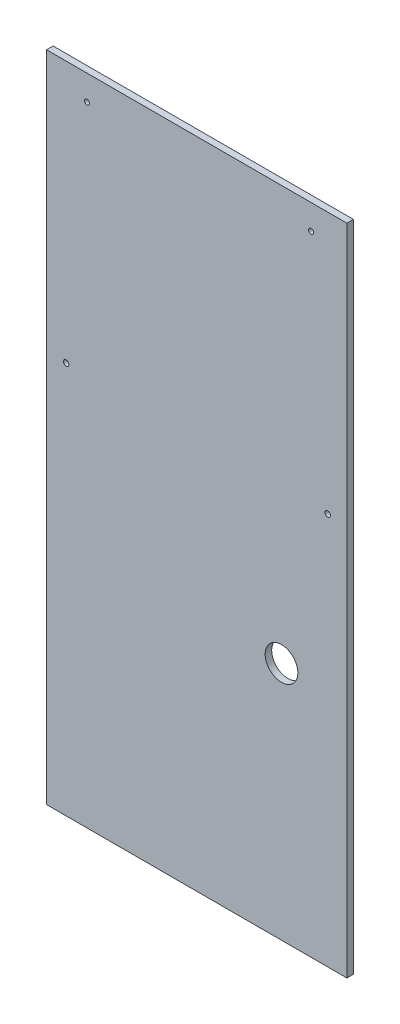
ISO-10303-21;
HEADER;
FILE_DESCRIPTION(('STEP AP214'),'2;1');
FILE_NAME('part.step','',(''),(''),'','','');
FILE_SCHEMA(('AUTOMOTIVE_DESIGN { 1 0 10303 214 1 1 1 1 }'));
ENDSEC;
DATA;
#1=APPLICATION_CONTEXT('core data for automotive mechanical design processes');
#2=APPLICATION_PROTOCOL_DEFINITION('international standard','automotive_design',2000,#1);
#3=PRODUCT_CONTEXT('',#1,'mechanical');
#4=PRODUCT('Part','Part','',(#3));
#5=PRODUCT_RELATED_PRODUCT_CATEGORY('part','',(#4));
#6=PRODUCT_DEFINITION_FORMATION('','',#4);
#7=PRODUCT_DEFINITION_CONTEXT('part definition',#1,'design');
#8=PRODUCT_DEFINITION('design','',#6,#7);
#9=PRODUCT_DEFINITION_SHAPE('','',#8);
#10=(LENGTH_UNIT() NAMED_UNIT(*) SI_UNIT(.MILLI.,.METRE.));
#11=(NAMED_UNIT(*) PLANE_ANGLE_UNIT() SI_UNIT($,.RADIAN.));
#12=(NAMED_UNIT(*) SI_UNIT($,.STERADIAN.) SOLID_ANGLE_UNIT());
#13=UNCERTAINTY_MEASURE_WITH_UNIT(LENGTH_MEASURE(1.E-05),#10,'distance_accuracy_value','');
#14=(GEOMETRIC_REPRESENTATION_CONTEXT(3) GLOBAL_UNCERTAINTY_ASSIGNED_CONTEXT((#13)) GLOBAL_UNIT_ASSIGNED_CONTEXT((#10,
#11,#12)) REPRESENTATION_CONTEXT('',''));
#15=CARTESIAN_POINT('',(0.,0.,0.));
#16=DIRECTION('',(0.,0.,1.));
#17=DIRECTION('',(1.,0.,0.));
#18=AXIS2_PLACEMENT_3D('',#15,#16,#17);
#19=CARTESIAN_POINT('',(175.006,-381.,7.62));
#20=DIRECTION('',(-1.,0.,0.));
#21=DIRECTION('',(0.,0.,1.));
#22=AXIS2_PLACEMENT_3D('',#19,#20,#21);
#23=PLANE('',#22);
#24=DIRECTION('',(0.,1.,0.));
#25=VECTOR('',#24,1.);
#26=CARTESIAN_POINT('',(175.006,-381.,0.));
#27=LINE('',#26,#25);
#28=CARTESIAN_POINT('',(175.006,-381.,0.));
#29=VERTEX_POINT('',#28);
#30=CARTESIAN_POINT('',(175.006,381.,0.));
#31=VERTEX_POINT('',#30);
#32=EDGE_CURVE('E102',#29,#31,#27,.T.);
#33=ORIENTED_EDGE('',*,*,#32,.T.);
#34=DIRECTION('',(0.,0.,-1.));
#35=VECTOR('',#34,1.);
#36=CARTESIAN_POINT('',(175.006,381.,7.62));
#37=LINE('',#36,#35);
#38=CARTESIAN_POINT('',(175.006,381.,7.62));
#39=VERTEX_POINT('',#38);
#40=EDGE_CURVE('E11',#39,#31,#37,.T.);
#41=ORIENTED_EDGE('',*,*,#40,.F.);
#42=DIRECTION('',(0.,1.,0.));
#43=VECTOR('',#42,1.);
#44=CARTESIAN_POINT('',(175.006,-381.,7.62));
#45=LINE('',#44,#43);
#46=CARTESIAN_POINT('',(175.006,-381.,7.62));
#47=VERTEX_POINT('',#46);
#48=EDGE_CURVE('E90',#47,#39,#45,.T.);
#49=ORIENTED_EDGE('',*,*,#48,.F.);
#50=DIRECTION('',(0.,0.,-1.));
#51=VECTOR('',#50,1.);
#52=CARTESIAN_POINT('',(175.006,-381.,7.62));
#53=LINE('',#52,#51);
#54=EDGE_CURVE('E98',#47,#29,#53,.T.);
#55=ORIENTED_EDGE('',*,*,#54,.T.);
#56=EDGE_LOOP('',(#33,#41,#49,#55));
#57=FACE_BOUND('',#56,.T.);
#58=ADVANCED_FACE('F39',(#57),#23,.F.);
#59=CARTESIAN_POINT('',(-175.006,381.,7.62));
#60=DIRECTION('',(0.,-1.,0.));
#61=DIRECTION('',(0.,0.,-1.));
#62=AXIS2_PLACEMENT_3D('',#59,#60,#61);
#63=PLANE('',#62);
#64=DIRECTION('',(-1.,0.,0.));
#65=VECTOR('',#64,1.);
#66=CARTESIAN_POINT('',(-175.006,381.,0.));
#67=LINE('',#66,#65);
#68=CARTESIAN_POINT('',(-175.006,381.,0.));
#69=VERTEX_POINT('',#68);
#70=EDGE_CURVE('E94',#31,#69,#67,.T.);
#71=ORIENTED_EDGE('',*,*,#70,.T.);
#72=DIRECTION('',(0.,0.,-1.));
#73=VECTOR('',#72,1.);
#74=CARTESIAN_POINT('',(-175.006,381.,7.62));
#75=LINE('',#74,#73);
#76=CARTESIAN_POINT('',(-175.006,381.,7.62));
#77=VERTEX_POINT('',#76);
#78=EDGE_CURVE('E47',#77,#69,#75,.T.);
#79=ORIENTED_EDGE('',*,*,#78,.F.);
#80=DIRECTION('',(-1.,0.,0.));
#81=VECTOR('',#80,1.);
#82=CARTESIAN_POINT('',(-175.006,381.,7.62));
#83=LINE('',#82,#81);
#84=EDGE_CURVE('E85',#39,#77,#83,.T.);
#85=ORIENTED_EDGE('',*,*,#84,.F.);
#86=ORIENTED_EDGE('',*,*,#40,.T.);
#87=EDGE_LOOP('',(#71,#79,#85,#86));
#88=FACE_BOUND('',#87,.T.);
#89=ADVANCED_FACE('F93',(#88),#63,.F.);
#90=CARTESIAN_POINT('',(-175.006,-381.,7.62));
#91=DIRECTION('',(1.,0.,0.));
#92=DIRECTION('',(0.,0.,-1.));
#93=AXIS2_PLACEMENT_3D('',#90,#91,#92);
#94=PLANE('',#93);
#95=DIRECTION('',(0.,-1.,0.));
#96=VECTOR('',#95,1.);
#97=CARTESIAN_POINT('',(-175.006,-381.,0.));
#98=LINE('',#97,#96);
#99=CARTESIAN_POINT('',(-175.006,-381.,0.));
#100=VERTEX_POINT('',#99);
#101=EDGE_CURVE('E72',#69,#100,#98,.T.);
#102=ORIENTED_EDGE('',*,*,#101,.T.);
#103=DIRECTION('',(0.,0.,-1.));
#104=VECTOR('',#103,1.);
#105=CARTESIAN_POINT('',(-175.006,-381.,7.62));
#106=LINE('',#105,#104);
#107=CARTESIAN_POINT('',(-175.006,-381.,7.62));
#108=VERTEX_POINT('',#107);
#109=EDGE_CURVE('E95',#108,#100,#106,.T.);
#110=ORIENTED_EDGE('',*,*,#109,.F.);
#111=DIRECTION('',(0.,-1.,0.));
#112=VECTOR('',#111,1.);
#113=CARTESIAN_POINT('',(-175.006,-381.,7.62));
#114=LINE('',#113,#112);
#115=EDGE_CURVE('E88',#77,#108,#114,.T.);
#116=ORIENTED_EDGE('',*,*,#115,.F.);
#117=ORIENTED_EDGE('',*,*,#78,.T.);
#118=EDGE_LOOP('',(#102,#110,#116,#117));
#119=FACE_BOUND('',#118,.T.);
#120=ADVANCED_FACE('F96',(#119),#94,.F.);
#121=CARTESIAN_POINT('',(-175.006,-381.,7.62));
#122=DIRECTION('',(0.,1.,0.));
#123=DIRECTION('',(0.,0.,1.));
#124=AXIS2_PLACEMENT_3D('',#121,#122,#123);
#125=PLANE('',#124);
#126=DIRECTION('',(1.,0.,0.));
#127=VECTOR('',#126,1.);
#128=CARTESIAN_POINT('',(-175.006,-381.,0.));
#129=LINE('',#128,#127);
#130=EDGE_CURVE('E78',#100,#29,#129,.T.);
#131=ORIENTED_EDGE('',*,*,#130,.T.);
#132=ORIENTED_EDGE('',*,*,#54,.F.);
#133=DIRECTION('',(1.,0.,0.));
#134=VECTOR('',#133,1.);
#135=CARTESIAN_POINT('',(-175.006,-381.,7.62));
#136=LINE('',#135,#134);
#137=EDGE_CURVE('E55',#108,#47,#136,.T.);
#138=ORIENTED_EDGE('',*,*,#137,.F.);
#139=ORIENTED_EDGE('',*,*,#109,.T.);
#140=EDGE_LOOP('',(#131,#132,#138,#139));
#141=FACE_BOUND('',#140,.T.);
#142=ADVANCED_FACE('F110',(#141),#125,.F.);
#143=CARTESIAN_POINT('',(0.,0.,7.62));
#144=DIRECTION('',(0.,0.,-1.));
#145=DIRECTION('',(-1.,0.,0.));
#146=AXIS2_PLACEMENT_3D('',#143,#144,#145);
#147=PLANE('',#146);
#148=CARTESIAN_POINT('',(152.60870096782,76.2,7.62));
#149=DIRECTION('',(0.,0.,1.));
#150=DIRECTION('',(1.,0.,0.));
#151=AXIS2_PLACEMENT_3D('',#148,#149,#150);
#152=CIRCLE('',#151,3.17499999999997);
#153=CARTESIAN_POINT('',(155.78370096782,76.2,7.62));
#154=VERTEX_POINT('',#153);
#155=EDGE_CURVE('E140',#154,#154,#152,.T.);
#156=ORIENTED_EDGE('',*,*,#155,.F.);
#157=EDGE_LOOP('',(#156));
#158=FACE_BOUND('',#157,.T.);
#159=CARTESIAN_POINT('',(-152.146,76.2,7.62));
#160=DIRECTION('',(0.,0.,1.));
#161=DIRECTION('',(1.,0.,0.));
#162=AXIS2_PLACEMENT_3D('',#159,#160,#161);
#163=CIRCLE('',#162,3.17499999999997);
#164=CARTESIAN_POINT('',(-148.971,76.2,7.62));
#165=VERTEX_POINT('',#164);
#166=EDGE_CURVE('E134',#165,#165,#163,.T.);
#167=ORIENTED_EDGE('',*,*,#166,.F.);
#168=EDGE_LOOP('',(#167));
#169=FACE_BOUND('',#168,.T.);
#170=CARTESIAN_POINT('',(98.806,-101.6,7.62));
#171=DIRECTION('',(0.,0.,1.));
#172=DIRECTION('',(1.,0.,0.));
#173=AXIS2_PLACEMENT_3D('',#170,#171,#172);
#174=CIRCLE('',#173,19.05);
#175=CARTESIAN_POINT('',(117.856,-101.6,7.62));
#176=VERTEX_POINT('',#175);
#177=EDGE_CURVE('E128',#176,#176,#174,.T.);
#178=ORIENTED_EDGE('',*,*,#177,.F.);
#179=EDGE_LOOP('',(#178));
#180=FACE_BOUND('',#179,.T.);
#181=CARTESIAN_POINT('',(-128.016,351.79,7.62));
#182=DIRECTION('',(0.,0.,1.));
#183=DIRECTION('',(1.,0.,0.));
#184=AXIS2_PLACEMENT_3D('',#181,#182,#183);
#185=CIRCLE('',#184,2.921);
#186=CARTESIAN_POINT('',(-125.095,351.79,7.62));
#187=VERTEX_POINT('',#186);
#188=EDGE_CURVE('E123',#187,#187,#185,.T.);
#189=ORIENTED_EDGE('',*,*,#188,.F.);
#190=EDGE_LOOP('',(#189));
#191=FACE_BOUND('',#190,.T.);
#192=CARTESIAN_POINT('',(133.35,351.79,7.62));
#193=DIRECTION('',(0.,0.,1.));
#194=DIRECTION('',(1.,0.,0.));
#195=AXIS2_PLACEMENT_3D('',#192,#193,#194);
#196=CIRCLE('',#195,2.921);
#197=CARTESIAN_POINT('',(136.271,351.79,7.62));
#198=VERTEX_POINT('',#197);
#199=EDGE_CURVE('E116',#198,#198,#196,.T.);
#200=ORIENTED_EDGE('',*,*,#199,.F.);
#201=EDGE_LOOP('',(#200));
#202=FACE_BOUND('',#201,.T.);
#203=ORIENTED_EDGE('',*,*,#48,.T.);
#204=ORIENTED_EDGE('',*,*,#84,.T.);
#205=ORIENTED_EDGE('',*,*,#115,.T.);
#206=ORIENTED_EDGE('',*,*,#137,.T.);
#207=EDGE_LOOP('',(#203,#204,#205,#206));
#208=FACE_BOUND('',#207,.T.);
#209=ADVANCED_FACE('F86',(#158,#169,#180,#191,#202,#208),#147,.F.);
#210=CARTESIAN_POINT('',(0.,0.,0.));
#211=DIRECTION('',(0.,0.,-1.));
#212=DIRECTION('',(-1.,0.,0.));
#213=AXIS2_PLACEMENT_3D('',#210,#211,#212);
#214=PLANE('',#213);
#215=CARTESIAN_POINT('',(152.60870096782,76.2,0.));
#216=DIRECTION('',(0.,0.,1.));
#217=DIRECTION('',(1.,0.,0.));
#218=AXIS2_PLACEMENT_3D('',#215,#216,#217);
#219=CIRCLE('',#218,3.17499999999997);
#220=CARTESIAN_POINT('',(155.78370096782,76.2,0.));
#221=VERTEX_POINT('',#220);
#222=EDGE_CURVE('E131',#221,#221,#219,.T.);
#223=ORIENTED_EDGE('',*,*,#222,.T.);
#224=EDGE_LOOP('',(#223));
#225=FACE_BOUND('',#224,.T.);
#226=CARTESIAN_POINT('',(-152.146,76.2,0.));
#227=DIRECTION('',(0.,0.,1.));
#228=DIRECTION('',(1.,0.,0.));
#229=AXIS2_PLACEMENT_3D('',#226,#227,#228);
#230=CIRCLE('',#229,3.17499999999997);
#231=CARTESIAN_POINT('',(-148.971,76.2,0.));
#232=VERTEX_POINT('',#231);
#233=EDGE_CURVE('E137',#232,#232,#230,.T.);
#234=ORIENTED_EDGE('',*,*,#233,.T.);
#235=EDGE_LOOP('',(#234));
#236=FACE_BOUND('',#235,.T.);
#237=CARTESIAN_POINT('',(98.806,-101.6,0.));
#238=DIRECTION('',(0.,0.,1.));
#239=DIRECTION('',(1.,0.,0.));
#240=AXIS2_PLACEMENT_3D('',#237,#238,#239);
#241=CIRCLE('',#240,19.05);
#242=CARTESIAN_POINT('',(117.856,-101.6,0.));
#243=VERTEX_POINT('',#242);
#244=EDGE_CURVE('E120',#243,#243,#241,.T.);
#245=ORIENTED_EDGE('',*,*,#244,.T.);
#246=EDGE_LOOP('',(#245));
#247=FACE_BOUND('',#246,.T.);
#248=CARTESIAN_POINT('',(-128.016,351.79,0.));
#249=DIRECTION('',(0.,0.,1.));
#250=DIRECTION('',(1.,0.,0.));
#251=AXIS2_PLACEMENT_3D('',#248,#249,#250);
#252=CIRCLE('',#251,2.921);
#253=CARTESIAN_POINT('',(-125.095,351.79,0.));
#254=VERTEX_POINT('',#253);
#255=EDGE_CURVE('E105',#254,#254,#252,.T.);
#256=ORIENTED_EDGE('',*,*,#255,.T.);
#257=EDGE_LOOP('',(#256));
#258=FACE_BOUND('',#257,.T.);
#259=CARTESIAN_POINT('',(133.35,351.79,0.));
#260=DIRECTION('',(0.,0.,1.));
#261=DIRECTION('',(1.,0.,0.));
#262=AXIS2_PLACEMENT_3D('',#259,#260,#261);
#263=CIRCLE('',#262,2.921);
#264=CARTESIAN_POINT('',(136.271,351.79,0.));
#265=VERTEX_POINT('',#264);
#266=EDGE_CURVE('E119',#265,#265,#263,.T.);
#267=ORIENTED_EDGE('',*,*,#266,.T.);
#268=EDGE_LOOP('',(#267));
#269=FACE_BOUND('',#268,.T.);
#270=ORIENTED_EDGE('',*,*,#32,.F.);
#271=ORIENTED_EDGE('',*,*,#130,.F.);
#272=ORIENTED_EDGE('',*,*,#101,.F.);
#273=ORIENTED_EDGE('',*,*,#70,.F.);
#274=EDGE_LOOP('',(#270,#271,#272,#273));
#275=FACE_BOUND('',#274,.T.);
#276=ADVANCED_FACE('F113',(#225,#236,#247,#258,#269,#275),#214,.T.);
#277=CARTESIAN_POINT('',(133.35,351.79,0.));
#278=DIRECTION('',(0.,0.,1.));
#279=DIRECTION('',(1.,0.,0.));
#280=AXIS2_PLACEMENT_3D('',#277,#278,#279);
#281=CYLINDRICAL_SURFACE('',#280,2.921);
#282=CARTESIAN_POINT('',(136.271,351.79,0.));
#283=CARTESIAN_POINT('',(136.271,351.79,0.0793749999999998));
#284=CARTESIAN_POINT('',(136.271,351.79,0.15875));
#285=CARTESIAN_POINT('',(136.271,351.79,0.3175));
#286=CARTESIAN_POINT('',(136.271,351.79,0.396875));
#287=CARTESIAN_POINT('',(136.271,351.79,0.555625));
#288=CARTESIAN_POINT('',(136.271,351.79,0.635));
#289=CARTESIAN_POINT('',(136.271,351.79,0.79375));
#290=CARTESIAN_POINT('',(136.271,351.79,0.873125));
#291=CARTESIAN_POINT('',(136.271,351.79,1.031875));
#292=CARTESIAN_POINT('',(136.271,351.79,1.11125));
#293=CARTESIAN_POINT('',(136.271,351.79,1.27));
#294=CARTESIAN_POINT('',(136.271,351.79,1.349375));
#295=CARTESIAN_POINT('',(136.271,351.79,1.508125));
#296=CARTESIAN_POINT('',(136.271,351.79,1.5875));
#297=CARTESIAN_POINT('',(136.271,351.79,1.74625));
#298=CARTESIAN_POINT('',(136.271,351.79,1.825625));
#299=CARTESIAN_POINT('',(136.271,351.79,1.984375));
#300=CARTESIAN_POINT('',(136.271,351.79,2.06375));
#301=CARTESIAN_POINT('',(136.271,351.79,2.2225));
#302=CARTESIAN_POINT('',(136.271,351.79,2.301875));
#303=CARTESIAN_POINT('',(136.271,351.79,2.460625));
#304=CARTESIAN_POINT('',(136.271,351.79,2.54));
#305=CARTESIAN_POINT('',(136.271,351.79,2.69875));
#306=CARTESIAN_POINT('',(136.271,351.79,2.778125));
#307=CARTESIAN_POINT('',(136.271,351.79,2.936875));
#308=CARTESIAN_POINT('',(136.271,351.79,3.01625));
#309=CARTESIAN_POINT('',(136.271,351.79,3.175));
#310=CARTESIAN_POINT('',(136.271,351.79,3.254375));
#311=CARTESIAN_POINT('',(136.271,351.79,3.413125));
#312=CARTESIAN_POINT('',(136.271,351.79,3.4925));
#313=CARTESIAN_POINT('',(136.271,351.79,3.65125));
#314=CARTESIAN_POINT('',(136.271,351.79,3.730625));
#315=CARTESIAN_POINT('',(136.271,351.79,3.889375));
#316=CARTESIAN_POINT('',(136.271,351.79,3.96875));
#317=CARTESIAN_POINT('',(136.271,351.79,4.1275));
#318=CARTESIAN_POINT('',(136.271,351.79,4.206875));
#319=CARTESIAN_POINT('',(136.271,351.79,4.365625));
#320=CARTESIAN_POINT('',(136.271,351.79,4.445));
#321=CARTESIAN_POINT('',(136.271,351.79,4.60375));
#322=CARTESIAN_POINT('',(136.271,351.79,4.683125));
#323=CARTESIAN_POINT('',(136.271,351.79,4.841875));
#324=CARTESIAN_POINT('',(136.271,351.79,4.92125));
#325=CARTESIAN_POINT('',(136.271,351.79,5.08));
#326=CARTESIAN_POINT('',(136.271,351.79,5.159375));
#327=CARTESIAN_POINT('',(136.271,351.79,5.318125));
#328=CARTESIAN_POINT('',(136.271,351.79,5.3975));
#329=CARTESIAN_POINT('',(136.271,351.79,5.55625));
#330=CARTESIAN_POINT('',(136.271,351.79,5.635625));
#331=CARTESIAN_POINT('',(136.271,351.79,5.794375));
#332=CARTESIAN_POINT('',(136.271,351.79,5.87375));
#333=CARTESIAN_POINT('',(136.271,351.79,6.0325));
#334=CARTESIAN_POINT('',(136.271,351.79,6.111875));
#335=CARTESIAN_POINT('',(136.271,351.79,6.270625));
#336=CARTESIAN_POINT('',(136.271,351.79,6.35));
#337=CARTESIAN_POINT('',(136.271,351.79,6.50875));
#338=CARTESIAN_POINT('',(136.271,351.79,6.588125));
#339=CARTESIAN_POINT('',(136.271,351.79,6.746875));
#340=CARTESIAN_POINT('',(136.271,351.79,6.82625));
#341=CARTESIAN_POINT('',(136.271,351.79,6.985));
#342=CARTESIAN_POINT('',(136.271,351.79,7.064375));
#343=CARTESIAN_POINT('',(136.271,351.79,7.223125));
#344=CARTESIAN_POINT('',(136.271,351.79,7.3025));
#345=CARTESIAN_POINT('',(136.271,351.79,7.46125));
#346=CARTESIAN_POINT('',(136.271,351.79,7.540625));
#347=CARTESIAN_POINT('',(136.271,351.79,7.62));
#348=B_SPLINE_CURVE_WITH_KNOTS('',3,(#282,#283,#284,#285,#286,#287,#288,#289,#290,#291,#292,
#293,#294,#295,#296,#297,#298,#299,#300,#301,#302,#303,#304,#305,#306,#307,#308,#309,#310,#311,
#312,#313,#314,#315,#316,#317,#318,#319,#320,#321,#322,#323,#324,#325,#326,#327,#328,#329,#330,
#331,#332,#333,#334,#335,#336,#337,#338,#339,#340,#341,#342,#343,#344,#345,#346,#347),
.UNSPECIFIED.,.F.,.F.,(4,2,2,2,2,2,2,2,2,2,2,2,2,2,2,2,2,2,2,2,2,2,2,2,2,2,2,2,2,2,2,2,4),(0.,
0.238125,0.47625,0.714375,0.9525,1.190625,1.42875,1.666875,1.905,2.143125,2.38125,2.619375,
2.8575,3.095625,3.33375,3.571875,3.81,4.048125,4.28625,4.524375,4.7625,5.000625,5.23875,
5.476875,5.715,5.953125,6.19125,6.429375,6.6675,6.905625,7.14375,7.381875,7.62),.UNSPECIFIED.);
#349=EDGE_CURVE('BSEAM166',#265,#198,#348,.T.);
#350=ORIENTED_EDGE('',*,*,#266,.F.);
#351=ORIENTED_EDGE('',*,*,#199,.T.);
#352=ORIENTED_EDGE('',*,*,#349,.T.);
#353=ORIENTED_EDGE('',*,*,#349,.F.);
#354=EDGE_LOOP('',(#350,#352,#351,#353));
#355=FACE_BOUND('',#354,.T.);
#356=ADVANCED_FACE('F166',(#355),#281,.F.);
#357=CARTESIAN_POINT('',(-128.016,351.79,0.));
#358=DIRECTION('',(0.,0.,1.));
#359=DIRECTION('',(1.,0.,0.));
#360=AXIS2_PLACEMENT_3D('',#357,#358,#359);
#361=CYLINDRICAL_SURFACE('',#360,2.921);
#362=CARTESIAN_POINT('',(-125.095,351.79,0.));
#363=CARTESIAN_POINT('',(-125.095,351.79,0.0793749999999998));
#364=CARTESIAN_POINT('',(-125.095,351.79,0.15875));
#365=CARTESIAN_POINT('',(-125.095,351.79,0.3175));
#366=CARTESIAN_POINT('',(-125.095,351.79,0.396875));
#367=CARTESIAN_POINT('',(-125.095,351.79,0.555625));
#368=CARTESIAN_POINT('',(-125.095,351.79,0.635));
#369=CARTESIAN_POINT('',(-125.095,351.79,0.79375));
#370=CARTESIAN_POINT('',(-125.095,351.79,0.873125));
#371=CARTESIAN_POINT('',(-125.095,351.79,1.031875));
#372=CARTESIAN_POINT('',(-125.095,351.79,1.11125));
#373=CARTESIAN_POINT('',(-125.095,351.79,1.27));
#374=CARTESIAN_POINT('',(-125.095,351.79,1.349375));
#375=CARTESIAN_POINT('',(-125.095,351.79,1.508125));
#376=CARTESIAN_POINT('',(-125.095,351.79,1.5875));
#377=CARTESIAN_POINT('',(-125.095,351.79,1.74625));
#378=CARTESIAN_POINT('',(-125.095,351.79,1.825625));
#379=CARTESIAN_POINT('',(-125.095,351.79,1.984375));
#380=CARTESIAN_POINT('',(-125.095,351.79,2.06375));
#381=CARTESIAN_POINT('',(-125.095,351.79,2.2225));
#382=CARTESIAN_POINT('',(-125.095,351.79,2.301875));
#383=CARTESIAN_POINT('',(-125.095,351.79,2.460625));
#384=CARTESIAN_POINT('',(-125.095,351.79,2.54));
#385=CARTESIAN_POINT('',(-125.095,351.79,2.69875));
#386=CARTESIAN_POINT('',(-125.095,351.79,2.778125));
#387=CARTESIAN_POINT('',(-125.095,351.79,2.936875));
#388=CARTESIAN_POINT('',(-125.095,351.79,3.01625));
#389=CARTESIAN_POINT('',(-125.095,351.79,3.175));
#390=CARTESIAN_POINT('',(-125.095,351.79,3.254375));
#391=CARTESIAN_POINT('',(-125.095,351.79,3.413125));
#392=CARTESIAN_POINT('',(-125.095,351.79,3.4925));
#393=CARTESIAN_POINT('',(-125.095,351.79,3.65125));
#394=CARTESIAN_POINT('',(-125.095,351.79,3.730625));
#395=CARTESIAN_POINT('',(-125.095,351.79,3.889375));
#396=CARTESIAN_POINT('',(-125.095,351.79,3.96875));
#397=CARTESIAN_POINT('',(-125.095,351.79,4.1275));
#398=CARTESIAN_POINT('',(-125.095,351.79,4.206875));
#399=CARTESIAN_POINT('',(-125.095,351.79,4.365625));
#400=CARTESIAN_POINT('',(-125.095,351.79,4.445));
#401=CARTESIAN_POINT('',(-125.095,351.79,4.60375));
#402=CARTESIAN_POINT('',(-125.095,351.79,4.683125));
#403=CARTESIAN_POINT('',(-125.095,351.79,4.841875));
#404=CARTESIAN_POINT('',(-125.095,351.79,4.92125));
#405=CARTESIAN_POINT('',(-125.095,351.79,5.08));
#406=CARTESIAN_POINT('',(-125.095,351.79,5.159375));
#407=CARTESIAN_POINT('',(-125.095,351.79,5.318125));
#408=CARTESIAN_POINT('',(-125.095,351.79,5.3975));
#409=CARTESIAN_POINT('',(-125.095,351.79,5.55625));
#410=CARTESIAN_POINT('',(-125.095,351.79,5.635625));
#411=CARTESIAN_POINT('',(-125.095,351.79,5.794375));
#412=CARTESIAN_POINT('',(-125.095,351.79,5.87375));
#413=CARTESIAN_POINT('',(-125.095,351.79,6.0325));
#414=CARTESIAN_POINT('',(-125.095,351.79,6.111875));
#415=CARTESIAN_POINT('',(-125.095,351.79,6.270625));
#416=CARTESIAN_POINT('',(-125.095,351.79,6.35));
#417=CARTESIAN_POINT('',(-125.095,351.79,6.50875));
#418=CARTESIAN_POINT('',(-125.095,351.79,6.588125));
#419=CARTESIAN_POINT('',(-125.095,351.79,6.746875));
#420=CARTESIAN_POINT('',(-125.095,351.79,6.82625));
#421=CARTESIAN_POINT('',(-125.095,351.79,6.985));
#422=CARTESIAN_POINT('',(-125.095,351.79,7.064375));
#423=CARTESIAN_POINT('',(-125.095,351.79,7.223125));
#424=CARTESIAN_POINT('',(-125.095,351.79,7.3025));
#425=CARTESIAN_POINT('',(-125.095,351.79,7.46125));
#426=CARTESIAN_POINT('',(-125.095,351.79,7.540625));
#427=CARTESIAN_POINT('',(-125.095,351.79,7.62));
#428=B_SPLINE_CURVE_WITH_KNOTS('',3,(#362,#363,#364,#365,#366,#367,#368,#369,#370,#371,#372,
#373,#374,#375,#376,#377,#378,#379,#380,#381,#382,#383,#384,#385,#386,#387,#388,#389,#390,#391,
#392,#393,#394,#395,#396,#397,#398,#399,#400,#401,#402,#403,#404,#405,#406,#407,#408,#409,#410,
#411,#412,#413,#414,#415,#416,#417,#418,#419,#420,#421,#422,#423,#424,#425,#426,#427),
.UNSPECIFIED.,.F.,.F.,(4,2,2,2,2,2,2,2,2,2,2,2,2,2,2,2,2,2,2,2,2,2,2,2,2,2,2,2,2,2,2,2,4),(0.,
0.238125,0.47625,0.714375,0.9525,1.190625,1.42875,1.666875,1.905,2.143125,2.38125,2.619375,
2.8575,3.095625,3.33375,3.571875,3.81,4.048125,4.28625,4.524375,4.7625,5.000625,5.23875,
5.476875,5.715,5.953125,6.19125,6.429375,6.6675,6.905625,7.14375,7.381875,7.62),.UNSPECIFIED.);
#429=EDGE_CURVE('BSEAM168',#254,#187,#428,.T.);
#430=ORIENTED_EDGE('',*,*,#255,.F.);
#431=ORIENTED_EDGE('',*,*,#188,.T.);
#432=ORIENTED_EDGE('',*,*,#429,.T.);
#433=ORIENTED_EDGE('',*,*,#429,.F.);
#434=EDGE_LOOP('',(#430,#432,#431,#433));
#435=FACE_BOUND('',#434,.T.);
#436=ADVANCED_FACE('F168',(#435),#361,.F.);
#437=CARTESIAN_POINT('',(98.806,-101.6,0.));
#438=DIRECTION('',(0.,0.,1.));
#439=DIRECTION('',(1.,0.,0.));
#440=AXIS2_PLACEMENT_3D('',#437,#438,#439);
#441=CYLINDRICAL_SURFACE('',#440,19.05);
#442=CARTESIAN_POINT('',(117.856,-101.6,0.));
#443=CARTESIAN_POINT('',(117.856,-101.6,0.0793749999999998));
#444=CARTESIAN_POINT('',(117.856,-101.6,0.15875));
#445=CARTESIAN_POINT('',(117.856,-101.6,0.3175));
#446=CARTESIAN_POINT('',(117.856,-101.6,0.396875));
#447=CARTESIAN_POINT('',(117.856,-101.6,0.555625));
#448=CARTESIAN_POINT('',(117.856,-101.6,0.635));
#449=CARTESIAN_POINT('',(117.856,-101.6,0.79375));
#450=CARTESIAN_POINT('',(117.856,-101.6,0.873125));
#451=CARTESIAN_POINT('',(117.856,-101.6,1.031875));
#452=CARTESIAN_POINT('',(117.856,-101.6,1.11125));
#453=CARTESIAN_POINT('',(117.856,-101.6,1.27));
#454=CARTESIAN_POINT('',(117.856,-101.6,1.349375));
#455=CARTESIAN_POINT('',(117.856,-101.6,1.508125));
#456=CARTESIAN_POINT('',(117.856,-101.6,1.5875));
#457=CARTESIAN_POINT('',(117.856,-101.6,1.74625));
#458=CARTESIAN_POINT('',(117.856,-101.6,1.825625));
#459=CARTESIAN_POINT('',(117.856,-101.6,1.984375));
#460=CARTESIAN_POINT('',(117.856,-101.6,2.06375));
#461=CARTESIAN_POINT('',(117.856,-101.6,2.2225));
#462=CARTESIAN_POINT('',(117.856,-101.6,2.301875));
#463=CARTESIAN_POINT('',(117.856,-101.6,2.460625));
#464=CARTESIAN_POINT('',(117.856,-101.6,2.54));
#465=CARTESIAN_POINT('',(117.856,-101.6,2.69875));
#466=CARTESIAN_POINT('',(117.856,-101.6,2.778125));
#467=CARTESIAN_POINT('',(117.856,-101.6,2.936875));
#468=CARTESIAN_POINT('',(117.856,-101.6,3.01625));
#469=CARTESIAN_POINT('',(117.856,-101.6,3.175));
#470=CARTESIAN_POINT('',(117.856,-101.6,3.254375));
#471=CARTESIAN_POINT('',(117.856,-101.6,3.413125));
#472=CARTESIAN_POINT('',(117.856,-101.6,3.4925));
#473=CARTESIAN_POINT('',(117.856,-101.6,3.65125));
#474=CARTESIAN_POINT('',(117.856,-101.6,3.730625));
#475=CARTESIAN_POINT('',(117.856,-101.6,3.889375));
#476=CARTESIAN_POINT('',(117.856,-101.6,3.96875));
#477=CARTESIAN_POINT('',(117.856,-101.6,4.1275));
#478=CARTESIAN_POINT('',(117.856,-101.6,4.206875));
#479=CARTESIAN_POINT('',(117.856,-101.6,4.365625));
#480=CARTESIAN_POINT('',(117.856,-101.6,4.445));
#481=CARTESIAN_POINT('',(117.856,-101.6,4.60375));
#482=CARTESIAN_POINT('',(117.856,-101.6,4.683125));
#483=CARTESIAN_POINT('',(117.856,-101.6,4.841875));
#484=CARTESIAN_POINT('',(117.856,-101.6,4.92125));
#485=CARTESIAN_POINT('',(117.856,-101.6,5.08));
#486=CARTESIAN_POINT('',(117.856,-101.6,5.159375));
#487=CARTESIAN_POINT('',(117.856,-101.6,5.318125));
#488=CARTESIAN_POINT('',(117.856,-101.6,5.3975));
#489=CARTESIAN_POINT('',(117.856,-101.6,5.55625));
#490=CARTESIAN_POINT('',(117.856,-101.6,5.635625));
#491=CARTESIAN_POINT('',(117.856,-101.6,5.794375));
#492=CARTESIAN_POINT('',(117.856,-101.6,5.87375));
#493=CARTESIAN_POINT('',(117.856,-101.6,6.0325));
#494=CARTESIAN_POINT('',(117.856,-101.6,6.111875));
#495=CARTESIAN_POINT('',(117.856,-101.6,6.270625));
#496=CARTESIAN_POINT('',(117.856,-101.6,6.35));
#497=CARTESIAN_POINT('',(117.856,-101.6,6.50875));
#498=CARTESIAN_POINT('',(117.856,-101.6,6.588125));
#499=CARTESIAN_POINT('',(117.856,-101.6,6.746875));
#500=CARTESIAN_POINT('',(117.856,-101.6,6.82625));
#501=CARTESIAN_POINT('',(117.856,-101.6,6.985));
#502=CARTESIAN_POINT('',(117.856,-101.6,7.064375));
#503=CARTESIAN_POINT('',(117.856,-101.6,7.223125));
#504=CARTESIAN_POINT('',(117.856,-101.6,7.3025));
#505=CARTESIAN_POINT('',(117.856,-101.6,7.46125));
#506=CARTESIAN_POINT('',(117.856,-101.6,7.540625));
#507=CARTESIAN_POINT('',(117.856,-101.6,7.62));
#508=B_SPLINE_CURVE_WITH_KNOTS('',3,(#442,#443,#444,#445,#446,#447,#448,#449,#450,#451,#452,
#453,#454,#455,#456,#457,#458,#459,#460,#461,#462,#463,#464,#465,#466,#467,#468,#469,#470,#471,
#472,#473,#474,#475,#476,#477,#478,#479,#480,#481,#482,#483,#484,#485,#486,#487,#488,#489,#490,
#491,#492,#493,#494,#495,#496,#497,#498,#499,#500,#501,#502,#503,#504,#505,#506,#507),
.UNSPECIFIED.,.F.,.F.,(4,2,2,2,2,2,2,2,2,2,2,2,2,2,2,2,2,2,2,2,2,2,2,2,2,2,2,2,2,2,2,2,4),(0.,
0.238125,0.47625,0.714375,0.9525,1.190625,1.42875,1.666875,1.905,2.143125,2.38125,2.619375,
2.8575,3.095625,3.33375,3.571875,3.81,4.048125,4.28625,4.524375,4.7625,5.000625,5.23875,
5.476875,5.715,5.953125,6.19125,6.429375,6.6675,6.905625,7.14375,7.381875,7.62),.UNSPECIFIED.);
#509=EDGE_CURVE('BSEAM175',#243,#176,#508,.T.);
#510=ORIENTED_EDGE('',*,*,#244,.F.);
#511=ORIENTED_EDGE('',*,*,#177,.T.);
#512=ORIENTED_EDGE('',*,*,#509,.T.);
#513=ORIENTED_EDGE('',*,*,#509,.F.);
#514=EDGE_LOOP('',(#510,#512,#511,#513));
#515=FACE_BOUND('',#514,.T.);
#516=ADVANCED_FACE('F175',(#515),#441,.F.);
#517=CARTESIAN_POINT('',(-152.146,76.2,0.));
#518=DIRECTION('',(0.,0.,1.));
#519=DIRECTION('',(1.,0.,0.));
#520=AXIS2_PLACEMENT_3D('',#517,#518,#519);
#521=CYLINDRICAL_SURFACE('',#520,3.17499999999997);
#522=CARTESIAN_POINT('',(-148.971,76.2,0.));
#523=CARTESIAN_POINT('',(-148.971,76.2,0.0793749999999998));
#524=CARTESIAN_POINT('',(-148.971,76.2,0.15875));
#525=CARTESIAN_POINT('',(-148.971,76.2,0.3175));
#526=CARTESIAN_POINT('',(-148.971,76.2,0.396875));
#527=CARTESIAN_POINT('',(-148.971,76.2,0.555625));
#528=CARTESIAN_POINT('',(-148.971,76.2,0.635));
#529=CARTESIAN_POINT('',(-148.971,76.2,0.79375));
#530=CARTESIAN_POINT('',(-148.971,76.2,0.873125));
#531=CARTESIAN_POINT('',(-148.971,76.2,1.031875));
#532=CARTESIAN_POINT('',(-148.971,76.2,1.11125));
#533=CARTESIAN_POINT('',(-148.971,76.2,1.27));
#534=CARTESIAN_POINT('',(-148.971,76.2,1.349375));
#535=CARTESIAN_POINT('',(-148.971,76.2,1.508125));
#536=CARTESIAN_POINT('',(-148.971,76.2,1.5875));
#537=CARTESIAN_POINT('',(-148.971,76.2,1.74625));
#538=CARTESIAN_POINT('',(-148.971,76.2,1.825625));
#539=CARTESIAN_POINT('',(-148.971,76.2,1.984375));
#540=CARTESIAN_POINT('',(-148.971,76.2,2.06375));
#541=CARTESIAN_POINT('',(-148.971,76.2,2.2225));
#542=CARTESIAN_POINT('',(-148.971,76.2,2.301875));
#543=CARTESIAN_POINT('',(-148.971,76.2,2.460625));
#544=CARTESIAN_POINT('',(-148.971,76.2,2.54));
#545=CARTESIAN_POINT('',(-148.971,76.2,2.69875));
#546=CARTESIAN_POINT('',(-148.971,76.2,2.778125));
#547=CARTESIAN_POINT('',(-148.971,76.2,2.936875));
#548=CARTESIAN_POINT('',(-148.971,76.2,3.01625));
#549=CARTESIAN_POINT('',(-148.971,76.2,3.175));
#550=CARTESIAN_POINT('',(-148.971,76.2,3.254375));
#551=CARTESIAN_POINT('',(-148.971,76.2,3.413125));
#552=CARTESIAN_POINT('',(-148.971,76.2,3.4925));
#553=CARTESIAN_POINT('',(-148.971,76.2,3.65125));
#554=CARTESIAN_POINT('',(-148.971,76.2,3.730625));
#555=CARTESIAN_POINT('',(-148.971,76.2,3.889375));
#556=CARTESIAN_POINT('',(-148.971,76.2,3.96875));
#557=CARTESIAN_POINT('',(-148.971,76.2,4.1275));
#558=CARTESIAN_POINT('',(-148.971,76.2,4.206875));
#559=CARTESIAN_POINT('',(-148.971,76.2,4.365625));
#560=CARTESIAN_POINT('',(-148.971,76.2,4.445));
#561=CARTESIAN_POINT('',(-148.971,76.2,4.60375));
#562=CARTESIAN_POINT('',(-148.971,76.2,4.683125));
#563=CARTESIAN_POINT('',(-148.971,76.2,4.841875));
#564=CARTESIAN_POINT('',(-148.971,76.2,4.92125));
#565=CARTESIAN_POINT('',(-148.971,76.2,5.08));
#566=CARTESIAN_POINT('',(-148.971,76.2,5.159375));
#567=CARTESIAN_POINT('',(-148.971,76.2,5.318125));
#568=CARTESIAN_POINT('',(-148.971,76.2,5.3975));
#569=CARTESIAN_POINT('',(-148.971,76.2,5.55625));
#570=CARTESIAN_POINT('',(-148.971,76.2,5.635625));
#571=CARTESIAN_POINT('',(-148.971,76.2,5.794375));
#572=CARTESIAN_POINT('',(-148.971,76.2,5.87375));
#573=CARTESIAN_POINT('',(-148.971,76.2,6.0325));
#574=CARTESIAN_POINT('',(-148.971,76.2,6.111875));
#575=CARTESIAN_POINT('',(-148.971,76.2,6.270625));
#576=CARTESIAN_POINT('',(-148.971,76.2,6.35));
#577=CARTESIAN_POINT('',(-148.971,76.2,6.50875));
#578=CARTESIAN_POINT('',(-148.971,76.2,6.588125));
#579=CARTESIAN_POINT('',(-148.971,76.2,6.746875));
#580=CARTESIAN_POINT('',(-148.971,76.2,6.82625));
#581=CARTESIAN_POINT('',(-148.971,76.2,6.985));
#582=CARTESIAN_POINT('',(-148.971,76.2,7.064375));
#583=CARTESIAN_POINT('',(-148.971,76.2,7.223125));
#584=CARTESIAN_POINT('',(-148.971,76.2,7.3025));
#585=CARTESIAN_POINT('',(-148.971,76.2,7.46125));
#586=CARTESIAN_POINT('',(-148.971,76.2,7.540625));
#587=CARTESIAN_POINT('',(-148.971,76.2,7.62));
#588=B_SPLINE_CURVE_WITH_KNOTS('',3,(#522,#523,#524,#525,#526,#527,#528,#529,#530,#531,#532,
#533,#534,#535,#536,#537,#538,#539,#540,#541,#542,#543,#544,#545,#546,#547,#548,#549,#550,#551,
#552,#553,#554,#555,#556,#557,#558,#559,#560,#561,#562,#563,#564,#565,#566,#567,#568,#569,#570,
#571,#572,#573,#574,#575,#576,#577,#578,#579,#580,#581,#582,#583,#584,#585,#586,#587),
.UNSPECIFIED.,.F.,.F.,(4,2,2,2,2,2,2,2,2,2,2,2,2,2,2,2,2,2,2,2,2,2,2,2,2,2,2,2,2,2,2,2,4),(0.,
0.238125,0.47625,0.714375,0.9525,1.190625,1.42875,1.666875,1.905,2.143125,2.38125,2.619375,
2.8575,3.095625,3.33375,3.571875,3.81,4.048125,4.28625,4.524375,4.7625,5.000625,5.23875,
5.476875,5.715,5.953125,6.19125,6.429375,6.6675,6.905625,7.14375,7.381875,7.62),.UNSPECIFIED.);
#589=EDGE_CURVE('BSEAM151',#232,#165,#588,.T.);
#590=ORIENTED_EDGE('',*,*,#233,.F.);
#591=ORIENTED_EDGE('',*,*,#166,.T.);
#592=ORIENTED_EDGE('',*,*,#589,.T.);
#593=ORIENTED_EDGE('',*,*,#589,.F.);
#594=EDGE_LOOP('',(#590,#592,#591,#593));
#595=FACE_BOUND('',#594,.T.);
#596=ADVANCED_FACE('F151',(#595),#521,.F.);
#597=CARTESIAN_POINT('',(152.60870096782,76.2,0.));
#598=DIRECTION('',(0.,0.,1.));
#599=DIRECTION('',(1.,0.,0.));
#600=AXIS2_PLACEMENT_3D('',#597,#598,#599);
#601=CYLINDRICAL_SURFACE('',#600,3.17499999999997);
#602=CARTESIAN_POINT('',(155.78370096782,76.2,0.));
#603=CARTESIAN_POINT('',(155.78370096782,76.2,0.0793749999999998));
#604=CARTESIAN_POINT('',(155.78370096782,76.2,0.15875));
#605=CARTESIAN_POINT('',(155.78370096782,76.2,0.3175));
#606=CARTESIAN_POINT('',(155.78370096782,76.2,0.396875));
#607=CARTESIAN_POINT('',(155.78370096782,76.2,0.555625));
#608=CARTESIAN_POINT('',(155.78370096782,76.2,0.635));
#609=CARTESIAN_POINT('',(155.78370096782,76.2,0.79375));
#610=CARTESIAN_POINT('',(155.78370096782,76.2,0.873125));
#611=CARTESIAN_POINT('',(155.78370096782,76.2,1.031875));
#612=CARTESIAN_POINT('',(155.78370096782,76.2,1.11125));
#613=CARTESIAN_POINT('',(155.78370096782,76.2,1.27));
#614=CARTESIAN_POINT('',(155.78370096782,76.2,1.349375));
#615=CARTESIAN_POINT('',(155.78370096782,76.2,1.508125));
#616=CARTESIAN_POINT('',(155.78370096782,76.2,1.5875));
#617=CARTESIAN_POINT('',(155.78370096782,76.2,1.74625));
#618=CARTESIAN_POINT('',(155.78370096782,76.2,1.825625));
#619=CARTESIAN_POINT('',(155.78370096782,76.2,1.984375));
#620=CARTESIAN_POINT('',(155.78370096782,76.2,2.06375));
#621=CARTESIAN_POINT('',(155.78370096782,76.2,2.2225));
#622=CARTESIAN_POINT('',(155.78370096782,76.2,2.301875));
#623=CARTESIAN_POINT('',(155.78370096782,76.2,2.460625));
#624=CARTESIAN_POINT('',(155.78370096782,76.2,2.54));
#625=CARTESIAN_POINT('',(155.78370096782,76.2,2.69875));
#626=CARTESIAN_POINT('',(155.78370096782,76.2,2.778125));
#627=CARTESIAN_POINT('',(155.78370096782,76.2,2.936875));
#628=CARTESIAN_POINT('',(155.78370096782,76.2,3.01625));
#629=CARTESIAN_POINT('',(155.78370096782,76.2,3.175));
#630=CARTESIAN_POINT('',(155.78370096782,76.2,3.254375));
#631=CARTESIAN_POINT('',(155.78370096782,76.2,3.413125));
#632=CARTESIAN_POINT('',(155.78370096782,76.2,3.4925));
#633=CARTESIAN_POINT('',(155.78370096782,76.2,3.65125));
#634=CARTESIAN_POINT('',(155.78370096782,76.2,3.730625));
#635=CARTESIAN_POINT('',(155.78370096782,76.2,3.889375));
#636=CARTESIAN_POINT('',(155.78370096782,76.2,3.96875));
#637=CARTESIAN_POINT('',(155.78370096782,76.2,4.1275));
#638=CARTESIAN_POINT('',(155.78370096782,76.2,4.206875));
#639=CARTESIAN_POINT('',(155.78370096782,76.2,4.365625));
#640=CARTESIAN_POINT('',(155.78370096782,76.2,4.445));
#641=CARTESIAN_POINT('',(155.78370096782,76.2,4.60375));
#642=CARTESIAN_POINT('',(155.78370096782,76.2,4.683125));
#643=CARTESIAN_POINT('',(155.78370096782,76.2,4.841875));
#644=CARTESIAN_POINT('',(155.78370096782,76.2,4.92125));
#645=CARTESIAN_POINT('',(155.78370096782,76.2,5.08));
#646=CARTESIAN_POINT('',(155.78370096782,76.2,5.159375));
#647=CARTESIAN_POINT('',(155.78370096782,76.2,5.318125));
#648=CARTESIAN_POINT('',(155.78370096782,76.2,5.3975));
#649=CARTESIAN_POINT('',(155.78370096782,76.2,5.55625));
#650=CARTESIAN_POINT('',(155.78370096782,76.2,5.635625));
#651=CARTESIAN_POINT('',(155.78370096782,76.2,5.794375));
#652=CARTESIAN_POINT('',(155.78370096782,76.2,5.87375));
#653=CARTESIAN_POINT('',(155.78370096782,76.2,6.0325));
#654=CARTESIAN_POINT('',(155.78370096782,76.2,6.111875));
#655=CARTESIAN_POINT('',(155.78370096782,76.2,6.270625));
#656=CARTESIAN_POINT('',(155.78370096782,76.2,6.35));
#657=CARTESIAN_POINT('',(155.78370096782,76.2,6.50875));
#658=CARTESIAN_POINT('',(155.78370096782,76.2,6.588125));
#659=CARTESIAN_POINT('',(155.78370096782,76.2,6.746875));
#660=CARTESIAN_POINT('',(155.78370096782,76.2,6.82625));
#661=CARTESIAN_POINT('',(155.78370096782,76.2,6.985));
#662=CARTESIAN_POINT('',(155.78370096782,76.2,7.064375));
#663=CARTESIAN_POINT('',(155.78370096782,76.2,7.223125));
#664=CARTESIAN_POINT('',(155.78370096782,76.2,7.3025));
#665=CARTESIAN_POINT('',(155.78370096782,76.2,7.46125));
#666=CARTESIAN_POINT('',(155.78370096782,76.2,7.540625));
#667=CARTESIAN_POINT('',(155.78370096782,76.2,7.62));
#668=B_SPLINE_CURVE_WITH_KNOTS('',3,(#602,#603,#604,#605,#606,#607,#608,#609,#610,#611,#612,
#613,#614,#615,#616,#617,#618,#619,#620,#621,#622,#623,#624,#625,#626,#627,#628,#629,#630,#631,
#632,#633,#634,#635,#636,#637,#638,#639,#640,#641,#642,#643,#644,#645,#646,#647,#648,#649,#650,
#651,#652,#653,#654,#655,#656,#657,#658,#659,#660,#661,#662,#663,#664,#665,#666,#667),
.UNSPECIFIED.,.F.,.F.,(4,2,2,2,2,2,2,2,2,2,2,2,2,2,2,2,2,2,2,2,2,2,2,2,2,2,2,2,2,2,2,2,4),(0.,
0.238125,0.47625,0.714375,0.9525,1.190625,1.42875,1.666875,1.905,2.143125,2.38125,2.619375,
2.8575,3.095625,3.33375,3.571875,3.81,4.048125,4.28625,4.524375,4.7625,5.000625,5.23875,
5.476875,5.715,5.953125,6.19125,6.429375,6.6675,6.905625,7.14375,7.381875,7.62),.UNSPECIFIED.);
#669=EDGE_CURVE('BSEAM148',#221,#154,#668,.T.);
#670=ORIENTED_EDGE('',*,*,#222,.F.);
#671=ORIENTED_EDGE('',*,*,#155,.T.);
#672=ORIENTED_EDGE('',*,*,#669,.T.);
#673=ORIENTED_EDGE('',*,*,#669,.F.);
#674=EDGE_LOOP('',(#670,#672,#671,#673));
#675=FACE_BOUND('',#674,.T.);
#676=ADVANCED_FACE('F148',(#675),#601,.F.);
#677=CLOSED_SHELL('',(#58,#89,#120,#142,#209,#276,#356,#436,#516,#596,#676));
#678=MANIFOLD_SOLID_BREP('B2',#677);
#679=ADVANCED_BREP_SHAPE_REPRESENTATION('',(#18,#678),#14);
#680=SHAPE_DEFINITION_REPRESENTATION(#9,#679);
ENDSEC;
END-ISO-10303-21;
